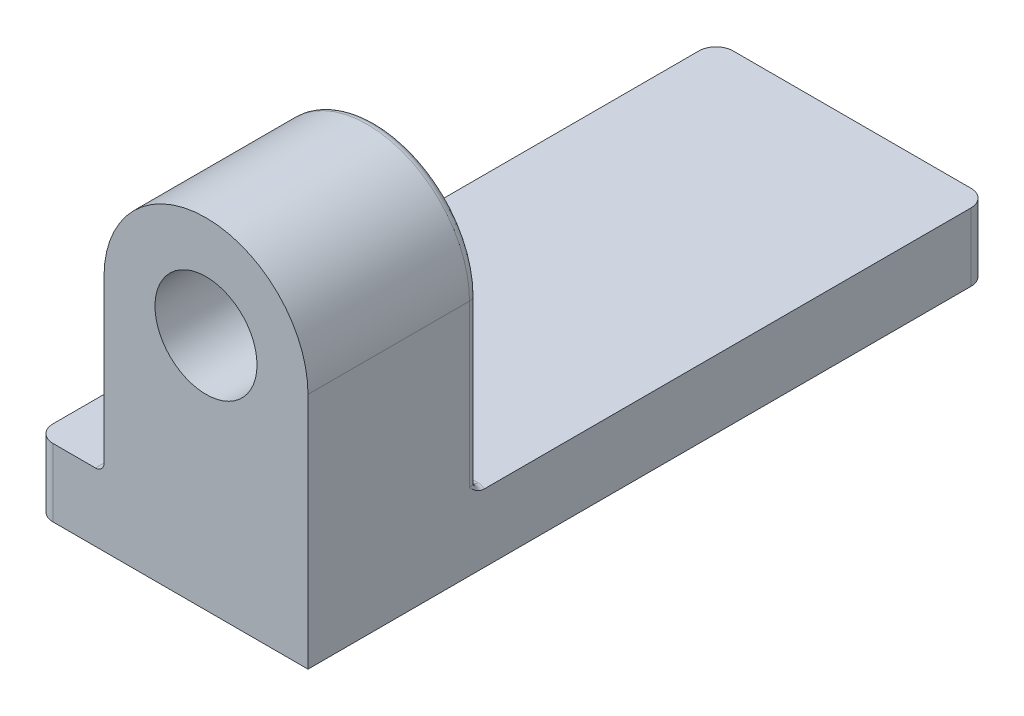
ISO-10303-21;
HEADER;
FILE_DESCRIPTION(('STEP AP214'),'2;1');
FILE_NAME('part.step','',(''),(''),'','','');
FILE_SCHEMA(('AUTOMOTIVE_DESIGN { 1 0 10303 214 1 1 1 1 }'));
ENDSEC;
DATA;
#1=APPLICATION_CONTEXT('core data for automotive mechanical design processes');
#2=APPLICATION_PROTOCOL_DEFINITION('international standard','automotive_design',2000,#1);
#3=PRODUCT_CONTEXT('',#1,'mechanical');
#4=PRODUCT('Part','Part','',(#3));
#5=PRODUCT_RELATED_PRODUCT_CATEGORY('part','',(#4));
#6=PRODUCT_DEFINITION_FORMATION('','',#4);
#7=PRODUCT_DEFINITION_CONTEXT('part definition',#1,'design');
#8=PRODUCT_DEFINITION('design','',#6,#7);
#9=PRODUCT_DEFINITION_SHAPE('','',#8);
#10=(LENGTH_UNIT() NAMED_UNIT(*) SI_UNIT(.MILLI.,.METRE.));
#11=(NAMED_UNIT(*) PLANE_ANGLE_UNIT() SI_UNIT($,.RADIAN.));
#12=(NAMED_UNIT(*) SI_UNIT($,.STERADIAN.) SOLID_ANGLE_UNIT());
#13=UNCERTAINTY_MEASURE_WITH_UNIT(LENGTH_MEASURE(1.E-05),#10,'distance_accuracy_value','');
#14=(GEOMETRIC_REPRESENTATION_CONTEXT(3) GLOBAL_UNCERTAINTY_ASSIGNED_CONTEXT((#13)) GLOBAL_UNIT_ASSIGNED_CONTEXT((#10,
#11,#12)) REPRESENTATION_CONTEXT('',''));
#15=CARTESIAN_POINT('',(0.,0.,0.));
#16=DIRECTION('',(0.,0.,1.));
#17=DIRECTION('',(1.,0.,0.));
#18=AXIS2_PLACEMENT_3D('',#15,#16,#17);
#19=CARTESIAN_POINT('',(50.8,12.7,127.));
#20=DIRECTION('',(0.,-1.,0.));
#21=DIRECTION('',(1.,0.,0.));
#22=AXIS2_PLACEMENT_3D('',#19,#20,#21);
#23=PLANE('',#22);
#24=DIRECTION('',(-1.,0.,0.));
#25=VECTOR('',#24,1.);
#26=CARTESIAN_POINT('',(50.8,12.7,127.));
#27=LINE('',#26,#25);
#28=CARTESIAN_POINT('',(11.1125,12.7,127.));
#29=VERTEX_POINT('',#28);
#30=CARTESIAN_POINT('',(3.175,12.7,127.));
#31=VERTEX_POINT('',#30);
#32=EDGE_CURVE('E179',#29,#31,#27,.T.);
#33=ORIENTED_EDGE('',*,*,#32,.F.);
#34=DIRECTION('',(0.,0.,1.));
#35=VECTOR('',#34,1.);
#36=CARTESIAN_POINT('',(11.1125,12.7,96.8375));
#37=LINE('',#36,#35);
#38=CARTESIAN_POINT('',(11.1125,12.7,96.8375));
#39=VERTEX_POINT('',#38);
#40=EDGE_CURVE('E292',#29,#39,#37,.F.);
#41=ORIENTED_EDGE('',*,*,#40,.T.);
#42=CARTESIAN_POINT('',(14.2875,12.7,96.8375));
#43=DIRECTION('',(0.,-1.,0.));
#44=DIRECTION('',(1.,0.,0.));
#45=AXIS2_PLACEMENT_3D('',#42,#43,#44);
#46=CIRCLE('',#45,3.175);
#47=CARTESIAN_POINT('',(14.2875,12.7,93.6625));
#48=VERTEX_POINT('',#47);
#49=EDGE_CURVE('E282',#39,#48,#46,.T.);
#50=ORIENTED_EDGE('',*,*,#49,.T.);
#51=DIRECTION('',(-1.,0.,0.));
#52=VECTOR('',#51,1.);
#53=CARTESIAN_POINT('',(50.8,12.7,93.6625));
#54=LINE('',#53,#52);
#55=CARTESIAN_POINT('',(49.2125,12.7,93.6625));
#56=VERTEX_POINT('',#55);
#57=EDGE_CURVE('E188',#48,#56,#54,.F.);
#58=ORIENTED_EDGE('',*,*,#57,.T.);
#59=CARTESIAN_POINT('',(49.2125,12.7,96.8375));
#60=DIRECTION('',(0.,-1.,0.));
#61=DIRECTION('',(1.,0.,0.));
#62=AXIS2_PLACEMENT_3D('',#59,#60,#61);
#63=CIRCLE('',#62,3.175);
#64=CARTESIAN_POINT('',(50.8,12.7,94.0878693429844));
#65=VERTEX_POINT('',#64);
#66=EDGE_CURVE('E291',#56,#65,#63,.T.);
#67=ORIENTED_EDGE('',*,*,#66,.T.);
#68=DIRECTION('',(0.,0.,-1.));
#69=VECTOR('',#68,1.);
#70=CARTESIAN_POINT('',(50.8,12.7,127.));
#71=LINE('',#70,#69);
#72=CARTESIAN_POINT('',(50.8,12.7,3.175));
#73=VERTEX_POINT('',#72);
#74=EDGE_CURVE('E183',#65,#73,#71,.T.);
#75=ORIENTED_EDGE('',*,*,#74,.T.);
#76=CARTESIAN_POINT('',(47.625,12.7,3.175));
#77=DIRECTION('',(0.,-1.,0.));
#78=DIRECTION('',(1.,0.,0.));
#79=AXIS2_PLACEMENT_3D('',#76,#77,#78);
#80=CIRCLE('',#79,3.175);
#81=CARTESIAN_POINT('',(47.625,12.7,0.));
#82=VERTEX_POINT('',#81);
#83=EDGE_CURVE('E240',#73,#82,#80,.F.);
#84=ORIENTED_EDGE('',*,*,#83,.T.);
#85=DIRECTION('',(-1.,0.,0.));
#86=VECTOR('',#85,1.);
#87=CARTESIAN_POINT('',(50.8,12.7,0.));
#88=LINE('',#87,#86);
#89=CARTESIAN_POINT('',(3.175,12.7,0.));
#90=VERTEX_POINT('',#89);
#91=EDGE_CURVE('E163',#82,#90,#88,.T.);
#92=ORIENTED_EDGE('',*,*,#91,.T.);
#93=CARTESIAN_POINT('',(3.175,12.7,3.175));
#94=DIRECTION('',(0.,-1.,0.));
#95=DIRECTION('',(1.,0.,0.));
#96=AXIS2_PLACEMENT_3D('',#93,#94,#95);
#97=CIRCLE('',#96,3.175);
#98=CARTESIAN_POINT('',(0.,12.7,3.175));
#99=VERTEX_POINT('',#98);
#100=EDGE_CURVE('E238',#90,#99,#97,.F.);
#101=ORIENTED_EDGE('',*,*,#100,.T.);
#102=DIRECTION('',(0.,0.,-1.));
#103=VECTOR('',#102,1.);
#104=CARTESIAN_POINT('',(0.,12.7,127.));
#105=LINE('',#104,#103);
#106=CARTESIAN_POINT('',(0.,12.7,123.825));
#107=VERTEX_POINT('',#106);
#108=EDGE_CURVE('E187',#107,#99,#105,.T.);
#109=ORIENTED_EDGE('',*,*,#108,.F.);
#110=CARTESIAN_POINT('',(3.175,12.7,123.825));
#111=DIRECTION('',(0.,-1.,0.));
#112=DIRECTION('',(1.,0.,0.));
#113=AXIS2_PLACEMENT_3D('',#110,#111,#112);
#114=CIRCLE('',#113,3.175);
#115=EDGE_CURVE('E235',#107,#31,#114,.F.);
#116=ORIENTED_EDGE('',*,*,#115,.T.);
#117=EDGE_LOOP('',(#33,#41,#50,#58,#67,#75,#84,#92,#101,#109,#116));
#118=FACE_BOUND('',#117,.T.);
#119=ADVANCED_FACE('F36',(#118),#23,.F.);
#120=CARTESIAN_POINT('',(0.,0.,127.));
#121=DIRECTION('',(-1.,0.,0.));
#122=DIRECTION('',(0.,0.,1.));
#123=AXIS2_PLACEMENT_3D('',#120,#121,#122);
#124=PLANE('',#123);
#125=DIRECTION('',(0.,0.,-1.));
#126=VECTOR('',#125,1.);
#127=CARTESIAN_POINT('',(0.,0.,127.));
#128=LINE('',#127,#126);
#129=CARTESIAN_POINT('',(0.,0.,123.825));
#130=VERTEX_POINT('',#129);
#131=CARTESIAN_POINT('',(0.,0.,3.175));
#132=VERTEX_POINT('',#131);
#133=EDGE_CURVE('E245',#130,#132,#128,.T.);
#134=ORIENTED_EDGE('',*,*,#133,.F.);
#135=DIRECTION('',(0.,1.,0.));
#136=VECTOR('',#135,1.);
#137=CARTESIAN_POINT('',(0.,12.7,123.825));
#138=LINE('',#137,#136);
#139=EDGE_CURVE('E242',#130,#107,#138,.T.);
#140=ORIENTED_EDGE('',*,*,#139,.T.);
#141=ORIENTED_EDGE('',*,*,#108,.T.);
#142=DIRECTION('',(0.,1.,0.));
#143=VECTOR('',#142,1.);
#144=CARTESIAN_POINT('',(0.,0.,3.175));
#145=LINE('',#144,#143);
#146=EDGE_CURVE('E244',#99,#132,#145,.F.);
#147=ORIENTED_EDGE('',*,*,#146,.T.);
#148=EDGE_LOOP('',(#134,#140,#141,#147));
#149=FACE_BOUND('',#148,.T.);
#150=ADVANCED_FACE('F313',(#149),#124,.T.);
#151=CARTESIAN_POINT('',(0.,0.,127.));
#152=DIRECTION('',(0.,1.,0.));
#153=DIRECTION('',(0.,0.,1.));
#154=AXIS2_PLACEMENT_3D('',#151,#152,#153);
#155=PLANE('',#154);
#156=DIRECTION('',(1.,0.,0.));
#157=VECTOR('',#156,1.);
#158=CARTESIAN_POINT('',(0.,0.,127.));
#159=LINE('',#158,#157);
#160=CARTESIAN_POINT('',(3.175,0.,127.));
#161=VERTEX_POINT('',#160);
#162=CARTESIAN_POINT('',(50.8,0.,127.));
#163=VERTEX_POINT('',#162);
#164=EDGE_CURVE('E196',#161,#163,#159,.T.);
#165=ORIENTED_EDGE('',*,*,#164,.F.);
#166=CARTESIAN_POINT('',(3.175,0.,123.825));
#167=DIRECTION('',(0.,1.,0.));
#168=DIRECTION('',(0.,0.,1.));
#169=AXIS2_PLACEMENT_3D('',#166,#167,#168);
#170=CIRCLE('',#169,3.175);
#171=EDGE_CURVE('E227',#161,#130,#170,.F.);
#172=ORIENTED_EDGE('',*,*,#171,.T.);
#173=ORIENTED_EDGE('',*,*,#133,.T.);
#174=CARTESIAN_POINT('',(3.175,0.,3.175));
#175=DIRECTION('',(0.,1.,0.));
#176=DIRECTION('',(0.,0.,1.));
#177=AXIS2_PLACEMENT_3D('',#174,#175,#176);
#178=CIRCLE('',#177,3.175);
#179=CARTESIAN_POINT('',(3.175,0.,0.));
#180=VERTEX_POINT('',#179);
#181=EDGE_CURVE('E229',#132,#180,#178,.F.);
#182=ORIENTED_EDGE('',*,*,#181,.T.);
#183=DIRECTION('',(1.,0.,0.));
#184=VECTOR('',#183,1.);
#185=CARTESIAN_POINT('',(0.,0.,0.));
#186=LINE('',#185,#184);
#187=CARTESIAN_POINT('',(47.625,0.,0.));
#188=VERTEX_POINT('',#187);
#189=EDGE_CURVE('E182',#180,#188,#186,.T.);
#190=ORIENTED_EDGE('',*,*,#189,.T.);
#191=CARTESIAN_POINT('',(47.625,0.,3.175));
#192=DIRECTION('',(0.,1.,0.));
#193=DIRECTION('',(0.,0.,1.));
#194=AXIS2_PLACEMENT_3D('',#191,#192,#193);
#195=CIRCLE('',#194,3.175);
#196=CARTESIAN_POINT('',(50.8,0.,3.175));
#197=VERTEX_POINT('',#196);
#198=EDGE_CURVE('E231',#188,#197,#195,.F.);
#199=ORIENTED_EDGE('',*,*,#198,.T.);
#200=DIRECTION('',(0.,0.,-1.));
#201=VECTOR('',#200,1.);
#202=CARTESIAN_POINT('',(50.8,0.,127.));
#203=LINE('',#202,#201);
#204=EDGE_CURVE('E186',#163,#197,#203,.T.);
#205=ORIENTED_EDGE('',*,*,#204,.F.);
#206=EDGE_LOOP('',(#165,#172,#173,#182,#190,#199,#205));
#207=FACE_BOUND('',#206,.T.);
#208=ADVANCED_FACE('F309',(#207),#155,.F.);
#209=CARTESIAN_POINT('',(50.8,12.7,127.));
#210=DIRECTION('',(1.,0.,0.));
#211=DIRECTION('',(0.,0.,-1.));
#212=AXIS2_PLACEMENT_3D('',#209,#210,#211);
#213=PLANE('',#212);
#214=ORIENTED_EDGE('',*,*,#74,.F.);
#215=CARTESIAN_POINT('',(50.8,12.7,94.0878693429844));
#216=CARTESIAN_POINT('',(50.8,12.6999955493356,94.1559025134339));
#217=CARTESIAN_POINT('',(50.8,12.7032798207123,94.2238771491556));
#218=CARTESIAN_POINT('',(50.8,12.7159892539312,94.3591514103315));
#219=CARTESIAN_POINT('',(50.8,12.7254050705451,94.4264519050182));
#220=CARTESIAN_POINT('',(50.8,12.7619044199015,94.6251391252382));
#221=CARTESIAN_POINT('',(50.8,12.7972631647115,94.7550420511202));
#222=CARTESIAN_POINT('',(50.8,12.9030433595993,95.055306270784));
#223=CARTESIAN_POINT('',(50.8,12.9816166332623,95.2227314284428));
#224=CARTESIAN_POINT('',(50.8,13.1640338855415,95.543831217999));
#225=CARTESIAN_POINT('',(50.8,13.2680166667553,95.6974237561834));
#226=CARTESIAN_POINT('',(50.8,13.5152642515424,96.0222459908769));
#227=CARTESIAN_POINT('',(50.8,13.662208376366,96.1905890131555));
#228=CARTESIAN_POINT('',(50.8,13.9667117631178,96.5165925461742));
#229=CARTESIAN_POINT('',(50.8,14.1242626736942,96.6742612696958));
#230=CARTESIAN_POINT('',(50.8,14.2837435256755,96.8337435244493));
#231=CARTESIAN_POINT('',(50.8,14.2856217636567,96.8356217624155));
#232=CARTESIAN_POINT('',(50.8,14.2875,96.8375));
#233=B_SPLINE_CURVE_WITH_KNOTS('',3,(#215,#216,#217,#218,#219,#220,#221,#222,#223,#224,#225,
#226,#227,#228,#229,#230,#231,#232),.UNSPECIFIED.,.F.,.F.,(4,2,2,2,2,2,2,2,4),(0.,
0.203924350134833,0.407538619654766,0.809647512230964,1.36141360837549,1.91626395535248,
2.58543870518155,3.25409260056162,3.26206128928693),.UNSPECIFIED.);
#234=CARTESIAN_POINT('',(50.8,14.2875,96.8375));
#235=VERTEX_POINT('',#234);
#236=EDGE_CURVE('E11',#65,#235,#233,.T.);
#237=ORIENTED_EDGE('',*,*,#236,.T.);
#238=DIRECTION('',(0.,-1.,0.));
#239=VECTOR('',#238,1.);
#240=CARTESIAN_POINT('',(50.8,12.7,96.8375));
#241=LINE('',#240,#239);
#242=CARTESIAN_POINT('',(50.8,44.45,96.8375));
#243=VERTEX_POINT('',#242);
#244=EDGE_CURVE('E207',#235,#243,#241,.F.);
#245=ORIENTED_EDGE('',*,*,#244,.T.);
#246=DIRECTION('',(0.,0.,1.));
#247=VECTOR('',#246,1.);
#248=CARTESIAN_POINT('',(50.8,44.45,95.25));
#249=LINE('',#248,#247);
#250=CARTESIAN_POINT('',(50.8,44.45,127.));
#251=VERTEX_POINT('',#250);
#252=EDGE_CURVE('E164',#243,#251,#249,.T.);
#253=ORIENTED_EDGE('',*,*,#252,.T.);
#254=DIRECTION('',(0.,-1.,0.));
#255=VECTOR('',#254,1.);
#256=CARTESIAN_POINT('',(50.8,12.7,127.));
#257=LINE('',#256,#255);
#258=EDGE_CURVE('E169',#251,#163,#257,.T.);
#259=ORIENTED_EDGE('',*,*,#258,.T.);
#260=ORIENTED_EDGE('',*,*,#204,.T.);
#261=DIRECTION('',(0.,-1.,0.));
#262=VECTOR('',#261,1.);
#263=CARTESIAN_POINT('',(50.8,12.7,3.175));
#264=LINE('',#263,#262);
#265=EDGE_CURVE('E218',#197,#73,#264,.F.);
#266=ORIENTED_EDGE('',*,*,#265,.T.);
#267=EDGE_LOOP('',(#214,#237,#245,#253,#259,#260,#266));
#268=FACE_BOUND('',#267,.T.);
#269=ADVANCED_FACE('F259',(#268),#213,.T.);
#270=CARTESIAN_POINT('',(0.,0.,127.));
#271=DIRECTION('',(0.,0.,-1.));
#272=DIRECTION('',(-1.,0.,0.));
#273=AXIS2_PLACEMENT_3D('',#270,#271,#272);
#274=PLANE('',#273);
#275=CARTESIAN_POINT('',(31.75,44.45,127.));
#276=DIRECTION('',(0.,0.,1.));
#277=DIRECTION('',(1.,0.,0.));
#278=AXIS2_PLACEMENT_3D('',#275,#276,#277);
#279=CIRCLE('',#278,9.525);
#280=CARTESIAN_POINT('',(41.275,44.45,127.));
#281=VERTEX_POINT('',#280);
#282=EDGE_CURVE('E173',#281,#281,#279,.T.);
#283=ORIENTED_EDGE('',*,*,#282,.F.);
#284=EDGE_LOOP('',(#283));
#285=FACE_BOUND('',#284,.T.);
#286=DIRECTION('',(0.,1.,0.));
#287=VECTOR('',#286,1.);
#288=CARTESIAN_POINT('',(12.7,12.7,127.));
#289=LINE('',#288,#287);
#290=CARTESIAN_POINT('',(12.7,14.2875,127.));
#291=VERTEX_POINT('',#290);
#292=CARTESIAN_POINT('',(12.7,44.45,127.));
#293=VERTEX_POINT('',#292);
#294=EDGE_CURVE('E144',#291,#293,#289,.T.);
#295=ORIENTED_EDGE('',*,*,#294,.F.);
#296=CARTESIAN_POINT('',(11.1125,14.2875,127.));
#297=DIRECTION('',(0.,0.,-1.));
#298=DIRECTION('',(-1.,0.,0.));
#299=AXIS2_PLACEMENT_3D('',#296,#297,#298);
#300=CIRCLE('',#299,1.5875);
#301=EDGE_CURVE('E46',#291,#29,#300,.T.);
#302=ORIENTED_EDGE('',*,*,#301,.T.);
#303=ORIENTED_EDGE('',*,*,#32,.T.);
#304=DIRECTION('',(0.,1.,0.));
#305=VECTOR('',#304,1.);
#306=CARTESIAN_POINT('',(3.175,0.,127.));
#307=LINE('',#306,#305);
#308=EDGE_CURVE('E233',#31,#161,#307,.F.);
#309=ORIENTED_EDGE('',*,*,#308,.T.);
#310=ORIENTED_EDGE('',*,*,#164,.T.);
#311=ORIENTED_EDGE('',*,*,#258,.F.);
#312=CARTESIAN_POINT('',(31.75,44.45,127.));
#313=DIRECTION('',(0.,0.,-1.));
#314=DIRECTION('',(-1.,0.,0.));
#315=AXIS2_PLACEMENT_3D('',#312,#313,#314);
#316=CIRCLE('',#315,19.05);
#317=EDGE_CURVE('E154',#293,#251,#316,.T.);
#318=ORIENTED_EDGE('',*,*,#317,.F.);
#319=EDGE_LOOP('',(#295,#302,#303,#309,#310,#311,#318));
#320=FACE_BOUND('',#319,.T.);
#321=ADVANCED_FACE('F167',(#285,#320),#274,.F.);
#322=CARTESIAN_POINT('',(0.,0.,0.));
#323=DIRECTION('',(0.,0.,-1.));
#324=DIRECTION('',(-1.,0.,0.));
#325=AXIS2_PLACEMENT_3D('',#322,#323,#324);
#326=PLANE('',#325);
#327=ORIENTED_EDGE('',*,*,#189,.F.);
#328=DIRECTION('',(0.,1.,0.));
#329=VECTOR('',#328,1.);
#330=CARTESIAN_POINT('',(3.175,0.,0.));
#331=LINE('',#330,#329);
#332=EDGE_CURVE('E221',#180,#90,#331,.T.);
#333=ORIENTED_EDGE('',*,*,#332,.T.);
#334=ORIENTED_EDGE('',*,*,#91,.F.);
#335=DIRECTION('',(0.,-1.,0.));
#336=VECTOR('',#335,1.);
#337=CARTESIAN_POINT('',(47.625,0.,0.));
#338=LINE('',#337,#336);
#339=EDGE_CURVE('E224',#82,#188,#338,.T.);
#340=ORIENTED_EDGE('',*,*,#339,.T.);
#341=EDGE_LOOP('',(#327,#333,#334,#340));
#342=FACE_BOUND('',#341,.T.);
#343=ADVANCED_FACE('F353',(#342),#326,.T.);
#344=CARTESIAN_POINT('',(12.7,12.7,95.25));
#345=DIRECTION('',(1.,0.,0.));
#346=DIRECTION('',(0.,0.,-1.));
#347=AXIS2_PLACEMENT_3D('',#344,#345,#346);
#348=PLANE('',#347);
#349=DIRECTION('',(0.,1.,0.));
#350=VECTOR('',#349,1.);
#351=CARTESIAN_POINT('',(12.7,12.7,96.8375));
#352=LINE('',#351,#350);
#353=CARTESIAN_POINT('',(12.7,44.45,96.8375));
#354=VERTEX_POINT('',#353);
#355=CARTESIAN_POINT('',(12.7,14.2875,96.8375));
#356=VERTEX_POINT('',#355);
#357=EDGE_CURVE('E210',#354,#356,#352,.F.);
#358=ORIENTED_EDGE('',*,*,#357,.T.);
#359=DIRECTION('',(0.,0.,1.));
#360=VECTOR('',#359,1.);
#361=CARTESIAN_POINT('',(12.7,14.2875,127.));
#362=LINE('',#361,#360);
#363=EDGE_CURVE('E151',#356,#291,#362,.T.);
#364=ORIENTED_EDGE('',*,*,#363,.T.);
#365=ORIENTED_EDGE('',*,*,#294,.T.);
#366=DIRECTION('',(0.,0.,1.));
#367=VECTOR('',#366,1.);
#368=CARTESIAN_POINT('',(12.7,44.45,95.25));
#369=LINE('',#368,#367);
#370=EDGE_CURVE('E148',#354,#293,#369,.T.);
#371=ORIENTED_EDGE('',*,*,#370,.F.);
#372=EDGE_LOOP('',(#358,#364,#365,#371));
#373=FACE_BOUND('',#372,.T.);
#374=ADVANCED_FACE('F147',(#373),#348,.F.);
#375=CARTESIAN_POINT('',(31.75,44.45,95.25));
#376=DIRECTION('',(0.,0.,1.));
#377=DIRECTION('',(1.,0.,0.));
#378=AXIS2_PLACEMENT_3D('',#375,#376,#377);
#379=CYLINDRICAL_SURFACE('',#378,19.05);
#380=ORIENTED_EDGE('',*,*,#252,.F.);
#381=CARTESIAN_POINT('',(31.75,44.45,96.8375));
#382=DIRECTION('',(0.,0.,-1.));
#383=DIRECTION('',(-1.,0.,0.));
#384=AXIS2_PLACEMENT_3D('',#381,#382,#383);
#385=CIRCLE('',#384,19.05);
#386=EDGE_CURVE('E162',#243,#354,#385,.F.);
#387=ORIENTED_EDGE('',*,*,#386,.T.);
#388=ORIENTED_EDGE('',*,*,#370,.T.);
#389=ORIENTED_EDGE('',*,*,#317,.T.);
#390=EDGE_LOOP('',(#380,#387,#388,#389));
#391=FACE_BOUND('',#390,.T.);
#392=ADVANCED_FACE('F160',(#391),#379,.T.);
#393=CARTESIAN_POINT('',(31.75,44.45,95.25));
#394=DIRECTION('',(0.,0.,-1.));
#395=DIRECTION('',(-1.,0.,0.));
#396=AXIS2_PLACEMENT_3D('',#393,#394,#395);
#397=PLANE('',#396);
#398=CARTESIAN_POINT('',(31.75,44.45,95.25));
#399=DIRECTION('',(0.,0.,-1.));
#400=DIRECTION('',(-1.,0.,0.));
#401=AXIS2_PLACEMENT_3D('',#398,#399,#400);
#402=CIRCLE('',#401,9.525);
#403=CARTESIAN_POINT('',(22.225,44.45,95.25));
#404=VERTEX_POINT('',#403);
#405=EDGE_CURVE('E155',#404,#404,#402,.T.);
#406=ORIENTED_EDGE('',*,*,#405,.F.);
#407=EDGE_LOOP('',(#406));
#408=FACE_BOUND('',#407,.T.);
#409=DIRECTION('',(0.,-1.,0.));
#410=VECTOR('',#409,1.);
#411=CARTESIAN_POINT('',(49.2125,44.45,95.25));
#412=LINE('',#411,#410);
#413=CARTESIAN_POINT('',(49.2125,44.45,95.25));
#414=VERTEX_POINT('',#413);
#415=CARTESIAN_POINT('',(49.2125,14.2875,95.25));
#416=VERTEX_POINT('',#415);
#417=EDGE_CURVE('E216',#414,#416,#412,.T.);
#418=ORIENTED_EDGE('',*,*,#417,.T.);
#419=DIRECTION('',(-1.,0.,0.));
#420=VECTOR('',#419,1.);
#421=CARTESIAN_POINT('',(31.75,14.2875,95.25));
#422=LINE('',#421,#420);
#423=CARTESIAN_POINT('',(14.2875,14.2875,95.25));
#424=VERTEX_POINT('',#423);
#425=EDGE_CURVE('E54',#416,#424,#422,.T.);
#426=ORIENTED_EDGE('',*,*,#425,.T.);
#427=DIRECTION('',(0.,1.,0.));
#428=VECTOR('',#427,1.);
#429=CARTESIAN_POINT('',(14.2875,44.45,95.25));
#430=LINE('',#429,#428);
#431=CARTESIAN_POINT('',(14.2875,44.45,95.25));
#432=VERTEX_POINT('',#431);
#433=EDGE_CURVE('E212',#424,#432,#430,.T.);
#434=ORIENTED_EDGE('',*,*,#433,.T.);
#435=CARTESIAN_POINT('',(31.75,44.45,95.25));
#436=DIRECTION('',(0.,0.,-1.));
#437=DIRECTION('',(-1.,0.,0.));
#438=AXIS2_PLACEMENT_3D('',#435,#436,#437);
#439=CIRCLE('',#438,17.4625);
#440=EDGE_CURVE('E214',#432,#414,#439,.T.);
#441=ORIENTED_EDGE('',*,*,#440,.T.);
#442=EDGE_LOOP('',(#418,#426,#434,#441));
#443=FACE_BOUND('',#442,.T.);
#444=ADVANCED_FACE('F395',(#408,#443),#397,.T.);
#445=CARTESIAN_POINT('',(31.75,44.45,-2.49999999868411E-05));
#446=DIRECTION('',(0.,0.,1.));
#447=DIRECTION('',(1.,0.,0.));
#448=AXIS2_PLACEMENT_3D('',#445,#446,#447);
#449=CYLINDRICAL_SURFACE('',#448,9.525);
#450=ORIENTED_EDGE('',*,*,#405,.T.);
#451=EDGE_LOOP('',(#450));
#452=FACE_BOUND('',#451,.T.);
#453=ORIENTED_EDGE('',*,*,#282,.T.);
#454=EDGE_LOOP('',(#453));
#455=FACE_BOUND('',#454,.T.);
#456=ADVANCED_FACE('F320',(#452,#455),#449,.F.);
#457=CARTESIAN_POINT('',(3.175,0.,123.825));
#458=DIRECTION('',(0.,-1.,0.));
#459=DIRECTION('',(0.,0.,-1.));
#460=AXIS2_PLACEMENT_3D('',#457,#458,#459);
#461=CYLINDRICAL_SURFACE('',#460,3.175);
#462=ORIENTED_EDGE('',*,*,#171,.F.);
#463=ORIENTED_EDGE('',*,*,#308,.F.);
#464=ORIENTED_EDGE('',*,*,#115,.F.);
#465=ORIENTED_EDGE('',*,*,#139,.F.);
#466=EDGE_LOOP('',(#462,#463,#464,#465));
#467=FACE_BOUND('',#466,.T.);
#468=ADVANCED_FACE('F316',(#467),#461,.T.);
#469=CARTESIAN_POINT('',(3.175,0.,3.175));
#470=DIRECTION('',(0.,1.,0.));
#471=DIRECTION('',(0.,0.,1.));
#472=AXIS2_PLACEMENT_3D('',#469,#470,#471);
#473=CYLINDRICAL_SURFACE('',#472,3.175);
#474=ORIENTED_EDGE('',*,*,#181,.F.);
#475=ORIENTED_EDGE('',*,*,#146,.F.);
#476=ORIENTED_EDGE('',*,*,#100,.F.);
#477=ORIENTED_EDGE('',*,*,#332,.F.);
#478=EDGE_LOOP('',(#474,#475,#476,#477));
#479=FACE_BOUND('',#478,.T.);
#480=ADVANCED_FACE('F319',(#479),#473,.T.);
#481=CARTESIAN_POINT('',(47.625,0.,3.175));
#482=DIRECTION('',(0.,-1.,0.));
#483=DIRECTION('',(0.,0.,-1.));
#484=AXIS2_PLACEMENT_3D('',#481,#482,#483);
#485=CYLINDRICAL_SURFACE('',#484,3.175);
#486=ORIENTED_EDGE('',*,*,#83,.F.);
#487=ORIENTED_EDGE('',*,*,#265,.F.);
#488=ORIENTED_EDGE('',*,*,#198,.F.);
#489=ORIENTED_EDGE('',*,*,#339,.F.);
#490=EDGE_LOOP('',(#486,#487,#488,#489));
#491=FACE_BOUND('',#490,.T.);
#492=ADVANCED_FACE('F324',(#491),#485,.T.);
#493=CARTESIAN_POINT('',(49.2125,44.45,96.8375));
#494=DIRECTION('',(0.,-1.,0.));
#495=DIRECTION('',(0.,0.,-1.));
#496=AXIS2_PLACEMENT_3D('',#493,#494,#495);
#497=CYLINDRICAL_SURFACE('',#496,1.5875);
#498=ORIENTED_EDGE('',*,*,#244,.F.);
#499=CARTESIAN_POINT('',(49.2125,14.2875,96.8375));
#500=DIRECTION('',(0.,-1.,0.));
#501=DIRECTION('',(1.,0.,0.));
#502=AXIS2_PLACEMENT_3D('',#499,#500,#501);
#503=CIRCLE('',#502,1.5875);
#504=EDGE_CURVE('E296',#235,#416,#503,.F.);
#505=ORIENTED_EDGE('',*,*,#504,.T.);
#506=ORIENTED_EDGE('',*,*,#417,.F.);
#507=CARTESIAN_POINT('',(49.2125,44.45,96.8375));
#508=DIRECTION('',(0.,1.,0.));
#509=DIRECTION('',(0.,0.,1.));
#510=AXIS2_PLACEMENT_3D('',#507,#508,#509);
#511=CIRCLE('',#510,1.5875);
#512=EDGE_CURVE('E201',#243,#414,#511,.T.);
#513=ORIENTED_EDGE('',*,*,#512,.F.);
#514=EDGE_LOOP('',(#498,#505,#506,#513));
#515=FACE_BOUND('',#514,.T.);
#516=ADVANCED_FACE('F264',(#515),#497,.T.);
#517=CARTESIAN_POINT('',(31.75,44.45,96.8375));
#518=DIRECTION('',(0.,0.,-1.));
#519=DIRECTION('',(-1.,0.,0.));
#520=AXIS2_PLACEMENT_3D('',#517,#518,#519);
#521=TOROIDAL_SURFACE('',#520,17.4625,1.5875);
#522=ORIENTED_EDGE('',*,*,#512,.T.);
#523=ORIENTED_EDGE('',*,*,#440,.F.);
#524=CARTESIAN_POINT('',(14.2875,44.45,96.8375));
#525=DIRECTION('',(0.,-1.,0.));
#526=DIRECTION('',(0.,0.,-1.));
#527=AXIS2_PLACEMENT_3D('',#524,#525,#526);
#528=CIRCLE('',#527,1.5875);
#529=EDGE_CURVE('E204',#354,#432,#528,.T.);
#530=ORIENTED_EDGE('',*,*,#529,.F.);
#531=ORIENTED_EDGE('',*,*,#386,.F.);
#532=EDGE_LOOP('',(#522,#523,#530,#531));
#533=FACE_BOUND('',#532,.T.);
#534=ADVANCED_FACE('F269',(#533),#521,.T.);
#535=CARTESIAN_POINT('',(14.2875,44.45,96.8375));
#536=DIRECTION('',(0.,-1.,0.));
#537=DIRECTION('',(0.,0.,-1.));
#538=AXIS2_PLACEMENT_3D('',#535,#536,#537);
#539=CYLINDRICAL_SURFACE('',#538,1.5875);
#540=ORIENTED_EDGE('',*,*,#433,.F.);
#541=CARTESIAN_POINT('',(14.2875,14.2875,96.8375));
#542=DIRECTION('',(0.,-1.,0.));
#543=DIRECTION('',(1.,0.,0.));
#544=AXIS2_PLACEMENT_3D('',#541,#542,#543);
#545=CIRCLE('',#544,1.5875);
#546=EDGE_CURVE('E274',#424,#356,#545,.F.);
#547=ORIENTED_EDGE('',*,*,#546,.T.);
#548=ORIENTED_EDGE('',*,*,#357,.F.);
#549=ORIENTED_EDGE('',*,*,#529,.T.);
#550=EDGE_LOOP('',(#540,#547,#548,#549));
#551=FACE_BOUND('',#550,.T.);
#552=ADVANCED_FACE('F271',(#551),#539,.T.);
#553=CARTESIAN_POINT('',(49.2125,14.2875,96.8375));
#554=DIRECTION('',(0.,-1.,0.));
#555=DIRECTION('',(1.,0.,0.));
#556=AXIS2_PLACEMENT_3D('',#553,#554,#555);
#557=TOROIDAL_SURFACE('',#556,3.175,1.5875);
#558=ORIENTED_EDGE('',*,*,#236,.F.);
#559=ORIENTED_EDGE('',*,*,#66,.F.);
#560=CARTESIAN_POINT('',(49.2125,14.2875,93.6625));
#561=DIRECTION('',(1.,0.,0.));
#562=DIRECTION('',(0.,0.,-1.));
#563=AXIS2_PLACEMENT_3D('',#560,#561,#562);
#564=CIRCLE('',#563,1.5875);
#565=EDGE_CURVE('E41',#416,#56,#564,.T.);
#566=ORIENTED_EDGE('',*,*,#565,.F.);
#567=ORIENTED_EDGE('',*,*,#504,.F.);
#568=EDGE_LOOP('',(#558,#559,#566,#567));
#569=FACE_BOUND('',#568,.T.);
#570=ADVANCED_FACE('F38',(#569),#557,.F.);
#571=CARTESIAN_POINT('',(31.75,14.2875,93.6625));
#572=DIRECTION('',(-1.,0.,0.));
#573=DIRECTION('',(0.,-1.,0.));
#574=AXIS2_PLACEMENT_3D('',#571,#572,#573);
#575=CYLINDRICAL_SURFACE('',#574,1.5875);
#576=ORIENTED_EDGE('',*,*,#565,.T.);
#577=ORIENTED_EDGE('',*,*,#57,.F.);
#578=CARTESIAN_POINT('',(14.2875,14.2875,93.6625));
#579=DIRECTION('',(1.,0.,0.));
#580=DIRECTION('',(0.,0.,-1.));
#581=AXIS2_PLACEMENT_3D('',#578,#579,#580);
#582=CIRCLE('',#581,1.5875);
#583=EDGE_CURVE('E285',#424,#48,#582,.T.);
#584=ORIENTED_EDGE('',*,*,#583,.F.);
#585=ORIENTED_EDGE('',*,*,#425,.F.);
#586=EDGE_LOOP('',(#576,#577,#584,#585));
#587=FACE_BOUND('',#586,.T.);
#588=ADVANCED_FACE('F338',(#587),#575,.F.);
#589=CARTESIAN_POINT('',(14.2875,14.2875,96.8375));
#590=DIRECTION('',(0.,-1.,0.));
#591=DIRECTION('',(1.,0.,0.));
#592=AXIS2_PLACEMENT_3D('',#589,#590,#591);
#593=TOROIDAL_SURFACE('',#592,3.175,1.5875);
#594=ORIENTED_EDGE('',*,*,#583,.T.);
#595=ORIENTED_EDGE('',*,*,#49,.F.);
#596=CARTESIAN_POINT('',(11.1125,14.2875,96.8375));
#597=DIRECTION('',(0.,0.,-1.));
#598=DIRECTION('',(-1.,0.,0.));
#599=AXIS2_PLACEMENT_3D('',#596,#597,#598);
#600=CIRCLE('',#599,1.5875);
#601=EDGE_CURVE('E279',#356,#39,#600,.T.);
#602=ORIENTED_EDGE('',*,*,#601,.F.);
#603=ORIENTED_EDGE('',*,*,#546,.F.);
#604=EDGE_LOOP('',(#594,#595,#602,#603));
#605=FACE_BOUND('',#604,.T.);
#606=ADVANCED_FACE('F281',(#605),#593,.F.);
#607=CARTESIAN_POINT('',(11.1125,14.2875,95.25));
#608=DIRECTION('',(0.,0.,-1.));
#609=DIRECTION('',(-1.,0.,0.));
#610=AXIS2_PLACEMENT_3D('',#607,#608,#609);
#611=CYLINDRICAL_SURFACE('',#610,1.5875);
#612=ORIENTED_EDGE('',*,*,#601,.T.);
#613=ORIENTED_EDGE('',*,*,#40,.F.);
#614=ORIENTED_EDGE('',*,*,#301,.F.);
#615=ORIENTED_EDGE('',*,*,#363,.F.);
#616=EDGE_LOOP('',(#612,#613,#614,#615));
#617=FACE_BOUND('',#616,.T.);
#618=ADVANCED_FACE('F287',(#617),#611,.F.);
#619=CLOSED_SHELL('',(#119,#150,#208,#269,#321,#343,#374,#392,#444,#456,#468,#480,#492,#516,
#534,#552,#570,#588,#606,#618));
#620=MANIFOLD_SOLID_BREP('B2',#619);
#621=ADVANCED_BREP_SHAPE_REPRESENTATION('',(#18,#620),#14);
#622=SHAPE_DEFINITION_REPRESENTATION(#9,#621);
ENDSEC;
END-ISO-10303-21;
